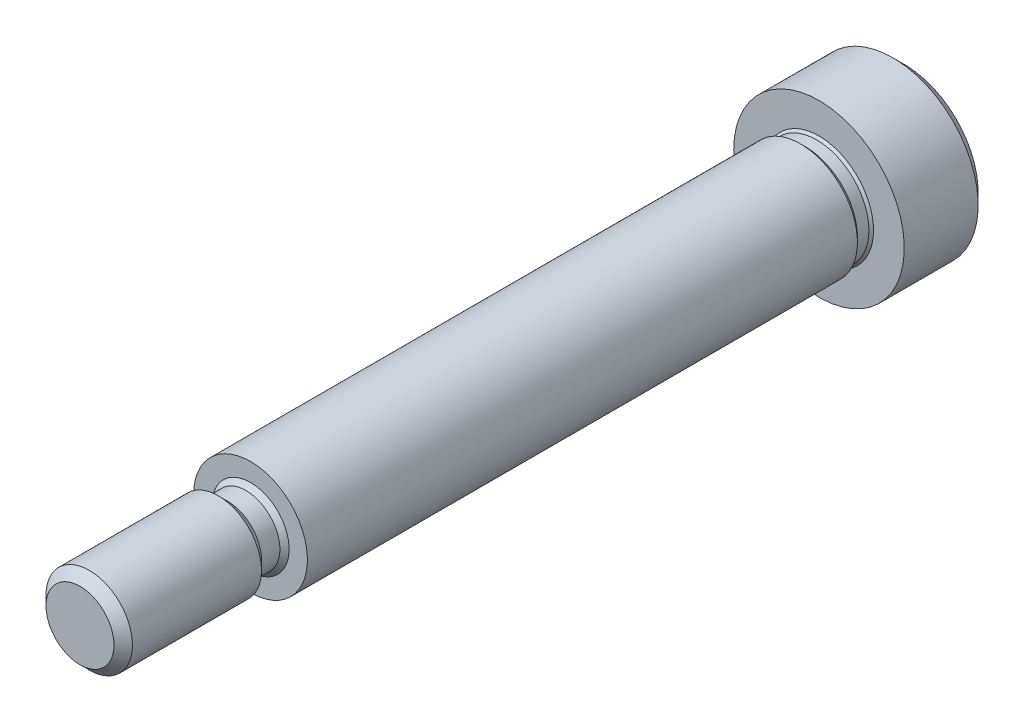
ISO-10303-21;
HEADER;
FILE_DESCRIPTION(('STEP AP214'),'2;1');
FILE_NAME('part.step','',(''),(''),'','','');
FILE_SCHEMA(('AUTOMOTIVE_DESIGN { 1 0 10303 214 1 1 1 1 }'));
ENDSEC;
DATA;
#1=APPLICATION_CONTEXT('core data for automotive mechanical design processes');
#2=APPLICATION_PROTOCOL_DEFINITION('international standard','automotive_design',2000,#1);
#3=PRODUCT_CONTEXT('',#1,'mechanical');
#4=PRODUCT('Part','Part','',(#3));
#5=PRODUCT_RELATED_PRODUCT_CATEGORY('part','',(#4));
#6=PRODUCT_DEFINITION_FORMATION('','',#4);
#7=PRODUCT_DEFINITION_CONTEXT('part definition',#1,'design');
#8=PRODUCT_DEFINITION('design','',#6,#7);
#9=PRODUCT_DEFINITION_SHAPE('','',#8);
#10=(LENGTH_UNIT() NAMED_UNIT(*) SI_UNIT(.MILLI.,.METRE.));
#11=(NAMED_UNIT(*) PLANE_ANGLE_UNIT() SI_UNIT($,.RADIAN.));
#12=(NAMED_UNIT(*) SI_UNIT($,.STERADIAN.) SOLID_ANGLE_UNIT());
#13=UNCERTAINTY_MEASURE_WITH_UNIT(LENGTH_MEASURE(1.E-05),#10,'distance_accuracy_value','');
#14=(GEOMETRIC_REPRESENTATION_CONTEXT(3) GLOBAL_UNCERTAINTY_ASSIGNED_CONTEXT((#13)) GLOBAL_UNIT_ASSIGNED_CONTEXT((#10,
#11,#12)) REPRESENTATION_CONTEXT('',''));
#15=CARTESIAN_POINT('',(0.,0.,0.));
#16=DIRECTION('',(0.,0.,1.));
#17=DIRECTION('',(1.,0.,0.));
#18=AXIS2_PLACEMENT_3D('',#15,#16,#17);
#19=CARTESIAN_POINT('',(0.,0.,-62.352722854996));
#20=DIRECTION('',(0.,0.,-1.));
#21=DIRECTION('',(-1.,0.,0.));
#22=AXIS2_PLACEMENT_3D('',#19,#20,#21);
#23=CYLINDRICAL_SURFACE('',#22,3.175);
#24=CARTESIAN_POINT('',(0.,0.,-30.7213));
#25=DIRECTION('',(0.,0.,-1.));
#26=DIRECTION('',(-1.,0.,0.));
#27=AXIS2_PLACEMENT_3D('',#24,#25,#26);
#28=CIRCLE('',#27,3.175);
#29=CARTESIAN_POINT('',(-3.17500000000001,0.,-30.7213));
#30=VERTEX_POINT('',#29);
#31=EDGE_CURVE('E164',#30,#30,#28,.T.);
#32=ORIENTED_EDGE('',*,*,#31,.F.);
#33=EDGE_LOOP('',(#32));
#34=FACE_BOUND('',#33,.T.);
#35=CARTESIAN_POINT('',(0.,0.,0.));
#36=DIRECTION('',(0.,0.,-1.));
#37=DIRECTION('',(-1.,0.,0.));
#38=AXIS2_PLACEMENT_3D('',#35,#36,#37);
#39=CIRCLE('',#38,3.175);
#40=CARTESIAN_POINT('',(-3.17500000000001,0.,0.));
#41=VERTEX_POINT('',#40);
#42=EDGE_CURVE('E11',#41,#41,#39,.T.);
#43=ORIENTED_EDGE('',*,*,#42,.T.);
#44=EDGE_LOOP('',(#43));
#45=FACE_BOUND('',#44,.T.);
#46=ADVANCED_FACE('F49',(#34,#45),#23,.T.);
#47=CARTESIAN_POINT('',(-3.17500000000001,0.,0.));
#48=DIRECTION('',(0.,0.,-1.));
#49=DIRECTION('',(-1.,0.,0.));
#50=AXIS2_PLACEMENT_3D('',#47,#48,#49);
#51=PLANE('',#50);
#52=ORIENTED_EDGE('',*,*,#42,.F.);
#53=EDGE_LOOP('',(#52));
#54=FACE_BOUND('',#53,.T.);
#55=CARTESIAN_POINT('',(0.,0.,0.));
#56=DIRECTION('',(0.,0.,-1.));
#57=DIRECTION('',(-1.,0.,0.));
#58=AXIS2_PLACEMENT_3D('',#55,#56,#57);
#59=CIRCLE('',#58,2.155825);
#60=CARTESIAN_POINT('',(-2.15582500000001,0.,0.));
#61=VERTEX_POINT('',#60);
#62=EDGE_CURVE('E57',#61,#61,#59,.T.);
#63=ORIENTED_EDGE('',*,*,#62,.T.);
#64=EDGE_LOOP('',(#63));
#65=FACE_BOUND('',#64,.T.);
#66=ADVANCED_FACE('F225',(#54,#65),#51,.F.);
#67=CARTESIAN_POINT('',(0.,0.,0.257174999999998));
#68=DIRECTION('',(0.,0.,-1.));
#69=DIRECTION('',(-1.,0.,0.));
#70=AXIS2_PLACEMENT_3D('',#67,#68,#69);
#71=CONICAL_SURFACE('',#70,1.89865,0.78539816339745);
#72=ORIENTED_EDGE('',*,*,#62,.F.);
#73=EDGE_LOOP('',(#72));
#74=FACE_BOUND('',#73,.T.);
#75=CARTESIAN_POINT('',(0.,0.,0.257174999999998));
#76=DIRECTION('',(0.,0.,-1.));
#77=DIRECTION('',(-1.,0.,0.));
#78=AXIS2_PLACEMENT_3D('',#75,#76,#77);
#79=CIRCLE('',#78,1.89865);
#80=CARTESIAN_POINT('',(-1.89865000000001,0.,0.257174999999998));
#81=VERTEX_POINT('',#80);
#82=EDGE_CURVE('E217',#81,#81,#79,.T.);
#83=ORIENTED_EDGE('',*,*,#82,.T.);
#84=EDGE_LOOP('',(#83));
#85=FACE_BOUND('',#84,.T.);
#86=ADVANCED_FACE('F227',(#74,#85),#71,.T.);
#87=CARTESIAN_POINT('',(0.,0.,-62.352722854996));
#88=DIRECTION('',(0.,0.,-1.));
#89=DIRECTION('',(-1.,0.,0.));
#90=AXIS2_PLACEMENT_3D('',#87,#88,#89);
#91=CYLINDRICAL_SURFACE('',#90,1.89865);
#92=ORIENTED_EDGE('',*,*,#82,.F.);
#93=EDGE_LOOP('',(#92));
#94=FACE_BOUND('',#93,.T.);
#95=CARTESIAN_POINT('',(0.,0.,1.28587500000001));
#96=DIRECTION('',(0.,0.,-1.));
#97=DIRECTION('',(-1.,0.,0.));
#98=AXIS2_PLACEMENT_3D('',#95,#96,#97);
#99=CIRCLE('',#98,1.89865);
#100=CARTESIAN_POINT('',(-1.89865000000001,0.,1.28587500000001));
#101=VERTEX_POINT('',#100);
#102=EDGE_CURVE('E213',#101,#101,#99,.T.);
#103=ORIENTED_EDGE('',*,*,#102,.T.);
#104=EDGE_LOOP('',(#103));
#105=FACE_BOUND('',#104,.T.);
#106=ADVANCED_FACE('F230',(#94,#105),#91,.T.);
#107=CARTESIAN_POINT('',(0.,0.,1.800225));
#108=DIRECTION('',(0.,0.,1.));
#109=DIRECTION('',(1.,0.,0.));
#110=AXIS2_PLACEMENT_3D('',#107,#108,#109);
#111=CONICAL_SURFACE('',#110,2.413,0.785398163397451);
#112=ORIENTED_EDGE('',*,*,#102,.F.);
#113=EDGE_LOOP('',(#112));
#114=FACE_BOUND('',#113,.T.);
#115=CARTESIAN_POINT('',(0.,0.,1.800225));
#116=DIRECTION('',(0.,0.,-1.));
#117=DIRECTION('',(-1.,0.,0.));
#118=AXIS2_PLACEMENT_3D('',#115,#116,#117);
#119=CIRCLE('',#118,2.413);
#120=CARTESIAN_POINT('',(-2.41300000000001,0.,1.800225));
#121=VERTEX_POINT('',#120);
#122=EDGE_CURVE('E209',#121,#121,#119,.T.);
#123=ORIENTED_EDGE('',*,*,#122,.T.);
#124=EDGE_LOOP('',(#123));
#125=FACE_BOUND('',#124,.T.);
#126=ADVANCED_FACE('F236',(#114,#125),#111,.T.);
#127=CARTESIAN_POINT('',(0.,0.,-62.352722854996));
#128=DIRECTION('',(0.,0.,-1.));
#129=DIRECTION('',(-1.,0.,0.));
#130=AXIS2_PLACEMENT_3D('',#127,#128,#129);
#131=CYLINDRICAL_SURFACE('',#130,2.413);
#132=ORIENTED_EDGE('',*,*,#122,.F.);
#133=EDGE_LOOP('',(#132));
#134=FACE_BOUND('',#133,.T.);
#135=CARTESIAN_POINT('',(0.,0.,9.01065000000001));
#136=DIRECTION('',(0.,0.,-1.));
#137=DIRECTION('',(-1.,0.,0.));
#138=AXIS2_PLACEMENT_3D('',#135,#136,#137);
#139=CIRCLE('',#138,2.413);
#140=CARTESIAN_POINT('',(-2.41300000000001,0.,9.01065000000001));
#141=VERTEX_POINT('',#140);
#142=EDGE_CURVE('E205',#141,#141,#139,.T.);
#143=ORIENTED_EDGE('',*,*,#142,.T.);
#144=EDGE_LOOP('',(#143));
#145=FACE_BOUND('',#144,.T.);
#146=ADVANCED_FACE('F242',(#134,#145),#131,.T.);
#147=CARTESIAN_POINT('',(0.,0.,9.52500000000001));
#148=DIRECTION('',(0.,0.,-1.));
#149=DIRECTION('',(-1.,0.,0.));
#150=AXIS2_PLACEMENT_3D('',#147,#148,#149);
#151=CONICAL_SURFACE('',#150,1.89865,0.785398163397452);
#152=ORIENTED_EDGE('',*,*,#142,.F.);
#153=EDGE_LOOP('',(#152));
#154=FACE_BOUND('',#153,.T.);
#155=CARTESIAN_POINT('',(0.,0.,9.52500000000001));
#156=DIRECTION('',(0.,0.,-1.));
#157=DIRECTION('',(-1.,0.,0.));
#158=AXIS2_PLACEMENT_3D('',#155,#156,#157);
#159=CIRCLE('',#158,1.89865);
#160=CARTESIAN_POINT('',(-1.89865000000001,0.,9.52500000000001));
#161=VERTEX_POINT('',#160);
#162=EDGE_CURVE('E201',#161,#161,#159,.T.);
#163=ORIENTED_EDGE('',*,*,#162,.T.);
#164=EDGE_LOOP('',(#163));
#165=FACE_BOUND('',#164,.T.);
#166=ADVANCED_FACE('F248',(#154,#165),#151,.T.);
#167=CARTESIAN_POINT('',(-1.89865000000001,0.,9.52500000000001));
#168=DIRECTION('',(0.,0.,-1.));
#169=DIRECTION('',(-1.,0.,0.));
#170=AXIS2_PLACEMENT_3D('',#167,#168,#169);
#171=PLANE('',#170);
#172=ORIENTED_EDGE('',*,*,#162,.F.);
#173=EDGE_LOOP('',(#172));
#174=FACE_BOUND('',#173,.T.);
#175=ADVANCED_FACE('F254',(#174),#171,.F.);
#176=CARTESIAN_POINT('',(-4.1275,0.,-36.5125));
#177=DIRECTION('',(0.,0.,1.));
#178=DIRECTION('',(1.,0.,0.));
#179=AXIS2_PLACEMENT_3D('',#176,#177,#178);
#180=PLANE('',#179);
#181=DIRECTION('',(-0.5,-0.866025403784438,0.));
#182=VECTOR('',#181,1.);
#183=CARTESIAN_POINT('',(1.83308710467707,0.,-36.5125));
#184=LINE('',#183,#182);
#185=CARTESIAN_POINT('',(1.83308710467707,0.,-36.5125));
#186=VERTEX_POINT('',#185);
#187=CARTESIAN_POINT('',(0.916543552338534,-1.58750000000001,-36.5125));
#188=VERTEX_POINT('',#187);
#189=EDGE_CURVE('E145',#186,#188,#184,.T.);
#190=ORIENTED_EDGE('',*,*,#189,.F.);
#191=DIRECTION('',(0.499999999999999,-0.866025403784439,0.));
#192=VECTOR('',#191,1.);
#193=CARTESIAN_POINT('',(0.916543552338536,1.5875,-36.5125));
#194=LINE('',#193,#192);
#195=CARTESIAN_POINT('',(0.916543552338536,1.5875,-36.5125));
#196=VERTEX_POINT('',#195);
#197=EDGE_CURVE('E64',#196,#186,#194,.T.);
#198=ORIENTED_EDGE('',*,*,#197,.F.);
#199=DIRECTION('',(1.,0.,0.));
#200=VECTOR('',#199,1.);
#201=CARTESIAN_POINT('',(-0.916543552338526,1.5875,-36.5125));
#202=LINE('',#201,#200);
#203=CARTESIAN_POINT('',(-0.916543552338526,1.5875,-36.5125));
#204=VERTEX_POINT('',#203);
#205=EDGE_CURVE('E158',#204,#196,#202,.T.);
#206=ORIENTED_EDGE('',*,*,#205,.F.);
#207=DIRECTION('',(0.5,0.866025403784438,0.));
#208=VECTOR('',#207,1.);
#209=CARTESIAN_POINT('',(-1.83308710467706,0.,-36.5125));
#210=LINE('',#209,#208);
#211=CARTESIAN_POINT('',(-1.83308710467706,0.,-36.5125));
#212=VERTEX_POINT('',#211);
#213=EDGE_CURVE('E155',#212,#204,#210,.T.);
#214=ORIENTED_EDGE('',*,*,#213,.F.);
#215=DIRECTION('',(-0.499999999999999,0.866025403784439,0.));
#216=VECTOR('',#215,1.);
#217=CARTESIAN_POINT('',(-0.916543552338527,-1.5875,-36.5125));
#218=LINE('',#217,#216);
#219=CARTESIAN_POINT('',(-0.916543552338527,-1.5875,-36.5125));
#220=VERTEX_POINT('',#219);
#221=EDGE_CURVE('E112',#220,#212,#218,.T.);
#222=ORIENTED_EDGE('',*,*,#221,.F.);
#223=DIRECTION('',(-1.,0.,0.));
#224=VECTOR('',#223,1.);
#225=CARTESIAN_POINT('',(0.916543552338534,-1.58750000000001,-36.5125));
#226=LINE('',#225,#224);
#227=EDGE_CURVE('E149',#188,#220,#226,.T.);
#228=ORIENTED_EDGE('',*,*,#227,.F.);
#229=EDGE_LOOP('',(#190,#198,#206,#214,#222,#228));
#230=FACE_BOUND('',#229,.T.);
#231=CARTESIAN_POINT('',(0.,0.,-36.5125));
#232=DIRECTION('',(0.,0.,-1.));
#233=DIRECTION('',(-1.,0.,0.));
#234=AXIS2_PLACEMENT_3D('',#231,#232,#233);
#235=CIRCLE('',#234,4.1275);
#236=CARTESIAN_POINT('',(-4.1275,0.,-36.5125));
#237=VERTEX_POINT('',#236);
#238=EDGE_CURVE('E197',#237,#237,#235,.T.);
#239=ORIENTED_EDGE('',*,*,#238,.T.);
#240=EDGE_LOOP('',(#239));
#241=FACE_BOUND('',#240,.T.);
#242=ADVANCED_FACE('F259',(#230,#241),#180,.F.);
#243=CARTESIAN_POINT('',(0.,0.,-35.8775));
#244=DIRECTION('',(0.,0.,1.));
#245=DIRECTION('',(1.,0.,0.));
#246=AXIS2_PLACEMENT_3D('',#243,#244,#245);
#247=CONICAL_SURFACE('',#246,4.7625,0.785398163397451);
#248=ORIENTED_EDGE('',*,*,#238,.F.);
#249=EDGE_LOOP('',(#248));
#250=FACE_BOUND('',#249,.T.);
#251=CARTESIAN_POINT('',(0.,0.,-35.8775));
#252=DIRECTION('',(0.,0.,-1.));
#253=DIRECTION('',(-1.,0.,0.));
#254=AXIS2_PLACEMENT_3D('',#251,#252,#253);
#255=CIRCLE('',#254,4.7625);
#256=CARTESIAN_POINT('',(-4.7625,0.,-35.8775));
#257=VERTEX_POINT('',#256);
#258=EDGE_CURVE('E193',#257,#257,#255,.T.);
#259=ORIENTED_EDGE('',*,*,#258,.T.);
#260=EDGE_LOOP('',(#259));
#261=FACE_BOUND('',#260,.T.);
#262=ADVANCED_FACE('F266',(#250,#261),#247,.T.);
#263=CARTESIAN_POINT('',(0.,0.,-62.352722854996));
#264=DIRECTION('',(0.,0.,-1.));
#265=DIRECTION('',(-1.,0.,0.));
#266=AXIS2_PLACEMENT_3D('',#263,#264,#265);
#267=CYLINDRICAL_SURFACE('',#266,4.7625);
#268=ORIENTED_EDGE('',*,*,#258,.F.);
#269=EDGE_LOOP('',(#268));
#270=FACE_BOUND('',#269,.T.);
#271=CARTESIAN_POINT('',(0.,0.,-31.75));
#272=DIRECTION('',(0.,0.,-1.));
#273=DIRECTION('',(-1.,0.,0.));
#274=AXIS2_PLACEMENT_3D('',#271,#272,#273);
#275=CIRCLE('',#274,4.7625);
#276=CARTESIAN_POINT('',(-4.7625,0.,-31.75));
#277=VERTEX_POINT('',#276);
#278=EDGE_CURVE('E189',#277,#277,#275,.T.);
#279=ORIENTED_EDGE('',*,*,#278,.T.);
#280=EDGE_LOOP('',(#279));
#281=FACE_BOUND('',#280,.T.);
#282=ADVANCED_FACE('F303',(#270,#281),#267,.T.);
#283=CARTESIAN_POINT('',(-3.04641250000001,0.,-31.75));
#284=DIRECTION('',(0.,0.,-1.));
#285=DIRECTION('',(-1.,0.,0.));
#286=AXIS2_PLACEMENT_3D('',#283,#284,#285);
#287=PLANE('',#286);
#288=ORIENTED_EDGE('',*,*,#278,.F.);
#289=EDGE_LOOP('',(#288));
#290=FACE_BOUND('',#289,.T.);
#291=CARTESIAN_POINT('',(0.,0.,-31.75));
#292=DIRECTION('',(0.,0.,-1.));
#293=DIRECTION('',(-1.,0.,0.));
#294=AXIS2_PLACEMENT_3D('',#291,#292,#293);
#295=CIRCLE('',#294,3.0464125);
#296=CARTESIAN_POINT('',(-3.04641250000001,0.,-31.75));
#297=VERTEX_POINT('',#296);
#298=EDGE_CURVE('E185',#297,#297,#295,.T.);
#299=ORIENTED_EDGE('',*,*,#298,.T.);
#300=EDGE_LOOP('',(#299));
#301=FACE_BOUND('',#300,.T.);
#302=ADVANCED_FACE('F299',(#290,#301),#287,.F.);
#303=CARTESIAN_POINT('',(0.,0.,-31.6214125));
#304=DIRECTION('',(0.,0.,-1.));
#305=DIRECTION('',(-1.,0.,0.));
#306=AXIS2_PLACEMENT_3D('',#303,#304,#305);
#307=CONICAL_SURFACE('',#306,2.917825,0.785398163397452);
#308=ORIENTED_EDGE('',*,*,#298,.F.);
#309=EDGE_LOOP('',(#308));
#310=FACE_BOUND('',#309,.T.);
#311=CARTESIAN_POINT('',(0.,0.,-31.6214125));
#312=DIRECTION('',(0.,0.,-1.));
#313=DIRECTION('',(-1.,0.,0.));
#314=AXIS2_PLACEMENT_3D('',#311,#312,#313);
#315=CIRCLE('',#314,2.917825);
#316=CARTESIAN_POINT('',(-2.91782500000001,0.,-31.6214125));
#317=VERTEX_POINT('',#316);
#318=EDGE_CURVE('E181',#317,#317,#315,.T.);
#319=ORIENTED_EDGE('',*,*,#318,.T.);
#320=EDGE_LOOP('',(#319));
#321=FACE_BOUND('',#320,.T.);
#322=ADVANCED_FACE('F291',(#310,#321),#307,.T.);
#323=CARTESIAN_POINT('',(0.,0.,-62.352722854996));
#324=DIRECTION('',(0.,0.,-1.));
#325=DIRECTION('',(-1.,0.,0.));
#326=AXIS2_PLACEMENT_3D('',#323,#324,#325);
#327=CYLINDRICAL_SURFACE('',#326,2.917825);
#328=ORIENTED_EDGE('',*,*,#318,.F.);
#329=EDGE_LOOP('',(#328));
#330=FACE_BOUND('',#329,.T.);
#331=CARTESIAN_POINT('',(0.,0.,-30.978475));
#332=DIRECTION('',(0.,0.,-1.));
#333=DIRECTION('',(-1.,0.,0.));
#334=AXIS2_PLACEMENT_3D('',#331,#332,#333);
#335=CIRCLE('',#334,2.917825);
#336=CARTESIAN_POINT('',(-2.91782500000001,0.,-30.978475));
#337=VERTEX_POINT('',#336);
#338=EDGE_CURVE('E177',#337,#337,#335,.T.);
#339=ORIENTED_EDGE('',*,*,#338,.T.);
#340=EDGE_LOOP('',(#339));
#341=FACE_BOUND('',#340,.T.);
#342=ADVANCED_FACE('F282',(#330,#341),#327,.T.);
#343=CARTESIAN_POINT('',(0.,0.,-30.7213));
#344=DIRECTION('',(0.,0.,1.));
#345=DIRECTION('',(1.,0.,0.));
#346=AXIS2_PLACEMENT_3D('',#343,#344,#345);
#347=CONICAL_SURFACE('',#346,3.175,0.785398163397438);
#348=ORIENTED_EDGE('',*,*,#338,.F.);
#349=EDGE_LOOP('',(#348));
#350=FACE_BOUND('',#349,.T.);
#351=ORIENTED_EDGE('',*,*,#31,.T.);
#352=EDGE_LOOP('',(#351));
#353=FACE_BOUND('',#352,.T.);
#354=ADVANCED_FACE('F279',(#350,#353),#347,.T.);
#355=CARTESIAN_POINT('',(0.916543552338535,1.5875,-33.3375));
#356=DIRECTION('',(0.866025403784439,0.5,0.));
#357=DIRECTION('',(-0.499999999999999,0.866025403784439,0.));
#358=AXIS2_PLACEMENT_3D('',#355,#356,#357);
#359=PLANE('',#358);
#360=ORIENTED_EDGE('',*,*,#197,.T.);
#361=DIRECTION('',(0.,0.,-1.));
#362=VECTOR('',#361,1.);
#363=CARTESIAN_POINT('',(1.83308710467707,0.,-33.3375));
#364=LINE('',#363,#362);
#365=CARTESIAN_POINT('',(1.83308710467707,0.,-33.3375));
#366=VERTEX_POINT('',#365);
#367=EDGE_CURVE('E94',#366,#186,#364,.T.);
#368=ORIENTED_EDGE('',*,*,#367,.F.);
#369=DIRECTION('',(0.499999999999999,-0.866025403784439,0.));
#370=VECTOR('',#369,1.);
#371=CARTESIAN_POINT('',(0.916543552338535,1.5875,-33.3375));
#372=LINE('',#371,#370);
#373=CARTESIAN_POINT('',(0.916543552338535,1.5875,-33.3375));
#374=VERTEX_POINT('',#373);
#375=EDGE_CURVE('E161',#374,#366,#372,.T.);
#376=ORIENTED_EDGE('',*,*,#375,.F.);
#377=DIRECTION('',(0.,0.,-1.));
#378=VECTOR('',#377,1.);
#379=CARTESIAN_POINT('',(0.916543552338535,1.5875,-33.3375));
#380=LINE('',#379,#378);
#381=EDGE_CURVE('E72',#374,#196,#380,.T.);
#382=ORIENTED_EDGE('',*,*,#381,.T.);
#383=EDGE_LOOP('',(#360,#368,#376,#382));
#384=FACE_BOUND('',#383,.T.);
#385=ADVANCED_FACE('F281',(#384),#359,.F.);
#386=CARTESIAN_POINT('',(-0.916543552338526,1.5875,-33.3375));
#387=DIRECTION('',(0.,1.,0.));
#388=DIRECTION('',(-1.,0.,0.));
#389=AXIS2_PLACEMENT_3D('',#386,#387,#388);
#390=PLANE('',#389);
#391=ORIENTED_EDGE('',*,*,#205,.T.);
#392=ORIENTED_EDGE('',*,*,#381,.F.);
#393=DIRECTION('',(1.,0.,0.));
#394=VECTOR('',#393,1.);
#395=CARTESIAN_POINT('',(-0.916543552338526,1.5875,-33.3375));
#396=LINE('',#395,#394);
#397=CARTESIAN_POINT('',(-0.916543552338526,1.5875,-33.3375));
#398=VERTEX_POINT('',#397);
#399=EDGE_CURVE('E126',#398,#374,#396,.T.);
#400=ORIENTED_EDGE('',*,*,#399,.F.);
#401=DIRECTION('',(0.,0.,-1.));
#402=VECTOR('',#401,1.);
#403=CARTESIAN_POINT('',(-0.916543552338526,1.5875,-33.3375));
#404=LINE('',#403,#402);
#405=EDGE_CURVE('E117',#398,#204,#404,.T.);
#406=ORIENTED_EDGE('',*,*,#405,.T.);
#407=EDGE_LOOP('',(#391,#392,#400,#406));
#408=FACE_BOUND('',#407,.T.);
#409=ADVANCED_FACE('F289',(#408),#390,.F.);
#410=CARTESIAN_POINT('',(-1.83308710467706,0.,-33.3375));
#411=DIRECTION('',(-0.866025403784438,0.5,0.));
#412=DIRECTION('',(-0.5,-0.866025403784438,0.));
#413=AXIS2_PLACEMENT_3D('',#410,#411,#412);
#414=PLANE('',#413);
#415=ORIENTED_EDGE('',*,*,#213,.T.);
#416=ORIENTED_EDGE('',*,*,#405,.F.);
#417=DIRECTION('',(0.5,0.866025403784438,0.));
#418=VECTOR('',#417,1.);
#419=CARTESIAN_POINT('',(-1.83308710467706,0.,-33.3375));
#420=LINE('',#419,#418);
#421=CARTESIAN_POINT('',(-1.83308710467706,0.,-33.3375));
#422=VERTEX_POINT('',#421);
#423=EDGE_CURVE('E121',#422,#398,#420,.T.);
#424=ORIENTED_EDGE('',*,*,#423,.F.);
#425=DIRECTION('',(0.,0.,-1.));
#426=VECTOR('',#425,1.);
#427=CARTESIAN_POINT('',(-1.83308710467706,0.,-33.3375));
#428=LINE('',#427,#426);
#429=EDGE_CURVE('E105',#422,#212,#428,.T.);
#430=ORIENTED_EDGE('',*,*,#429,.T.);
#431=EDGE_LOOP('',(#415,#416,#424,#430));
#432=FACE_BOUND('',#431,.T.);
#433=ADVANCED_FACE('F122',(#432),#414,.F.);
#434=CARTESIAN_POINT('',(-0.916543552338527,-1.5875,-33.3375));
#435=DIRECTION('',(-0.866025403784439,-0.5,0.));
#436=DIRECTION('',(0.499999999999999,-0.866025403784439,0.));
#437=AXIS2_PLACEMENT_3D('',#434,#435,#436);
#438=PLANE('',#437);
#439=ORIENTED_EDGE('',*,*,#221,.T.);
#440=ORIENTED_EDGE('',*,*,#429,.F.);
#441=DIRECTION('',(-0.499999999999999,0.866025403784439,0.));
#442=VECTOR('',#441,1.);
#443=CARTESIAN_POINT('',(-0.916543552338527,-1.5875,-33.3375));
#444=LINE('',#443,#442);
#445=CARTESIAN_POINT('',(-0.916543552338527,-1.5875,-33.3375));
#446=VERTEX_POINT('',#445);
#447=EDGE_CURVE('E109',#446,#422,#444,.T.);
#448=ORIENTED_EDGE('',*,*,#447,.F.);
#449=DIRECTION('',(0.,0.,-1.));
#450=VECTOR('',#449,1.);
#451=CARTESIAN_POINT('',(-0.916543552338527,-1.5875,-33.3375));
#452=LINE('',#451,#450);
#453=EDGE_CURVE('E118',#446,#220,#452,.T.);
#454=ORIENTED_EDGE('',*,*,#453,.T.);
#455=EDGE_LOOP('',(#439,#440,#448,#454));
#456=FACE_BOUND('',#455,.T.);
#457=ADVANCED_FACE('F107',(#456),#438,.F.);
#458=CARTESIAN_POINT('',(0.916543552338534,-1.58750000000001,-33.3375));
#459=DIRECTION('',(0.,-1.,0.));
#460=DIRECTION('',(1.,0.,0.));
#461=AXIS2_PLACEMENT_3D('',#458,#459,#460);
#462=PLANE('',#461);
#463=ORIENTED_EDGE('',*,*,#227,.T.);
#464=ORIENTED_EDGE('',*,*,#453,.F.);
#465=DIRECTION('',(-1.,0.,0.));
#466=VECTOR('',#465,1.);
#467=CARTESIAN_POINT('',(0.916543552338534,-1.58750000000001,-33.3375));
#468=LINE('',#467,#466);
#469=CARTESIAN_POINT('',(0.916543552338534,-1.58750000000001,-33.3375));
#470=VERTEX_POINT('',#469);
#471=EDGE_CURVE('E132',#470,#446,#468,.T.);
#472=ORIENTED_EDGE('',*,*,#471,.F.);
#473=DIRECTION('',(0.,0.,-1.));
#474=VECTOR('',#473,1.);
#475=CARTESIAN_POINT('',(0.916543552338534,-1.58750000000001,-33.3375));
#476=LINE('',#475,#474);
#477=EDGE_CURVE('E169',#470,#188,#476,.T.);
#478=ORIENTED_EDGE('',*,*,#477,.T.);
#479=EDGE_LOOP('',(#463,#464,#472,#478));
#480=FACE_BOUND('',#479,.T.);
#481=ADVANCED_FACE('F386',(#480),#462,.F.);
#482=CARTESIAN_POINT('',(1.83308710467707,0.,-33.3375));
#483=DIRECTION('',(0.866025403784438,-0.5,0.));
#484=DIRECTION('',(0.5,0.866025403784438,0.));
#485=AXIS2_PLACEMENT_3D('',#482,#483,#484);
#486=PLANE('',#485);
#487=ORIENTED_EDGE('',*,*,#189,.T.);
#488=ORIENTED_EDGE('',*,*,#477,.F.);
#489=DIRECTION('',(-0.5,-0.866025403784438,0.));
#490=VECTOR('',#489,1.);
#491=CARTESIAN_POINT('',(1.83308710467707,0.,-33.3375));
#492=LINE('',#491,#490);
#493=EDGE_CURVE('E137',#366,#470,#492,.T.);
#494=ORIENTED_EDGE('',*,*,#493,.F.);
#495=ORIENTED_EDGE('',*,*,#367,.T.);
#496=EDGE_LOOP('',(#487,#488,#494,#495));
#497=FACE_BOUND('',#496,.T.);
#498=ADVANCED_FACE('F397',(#497),#486,.F.);
#499=CARTESIAN_POINT('',(0.916543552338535,1.5875,-33.3375));
#500=DIRECTION('',(0.,0.,1.));
#501=DIRECTION('',(1.,0.,0.));
#502=AXIS2_PLACEMENT_3D('',#499,#500,#501);
#503=PLANE('',#502);
#504=ORIENTED_EDGE('',*,*,#375,.T.);
#505=ORIENTED_EDGE('',*,*,#493,.T.);
#506=ORIENTED_EDGE('',*,*,#471,.T.);
#507=ORIENTED_EDGE('',*,*,#447,.T.);
#508=ORIENTED_EDGE('',*,*,#423,.T.);
#509=ORIENTED_EDGE('',*,*,#399,.T.);
#510=EDGE_LOOP('',(#504,#505,#506,#507,#508,#509));
#511=FACE_BOUND('',#510,.T.);
#512=ADVANCED_FACE('F129',(#511),#503,.F.);
#513=CLOSED_SHELL('',(#46,#66,#86,#106,#126,#146,#166,#175,#242,#262,#282,#302,#322,#342,#354,
#385,#409,#433,#457,#481,#498,#512));
#514=MANIFOLD_SOLID_BREP('B2',#513);
#515=ADVANCED_BREP_SHAPE_REPRESENTATION('',(#18,#514),#14);
#516=SHAPE_DEFINITION_REPRESENTATION(#9,#515);
ENDSEC;
END-ISO-10303-21;
